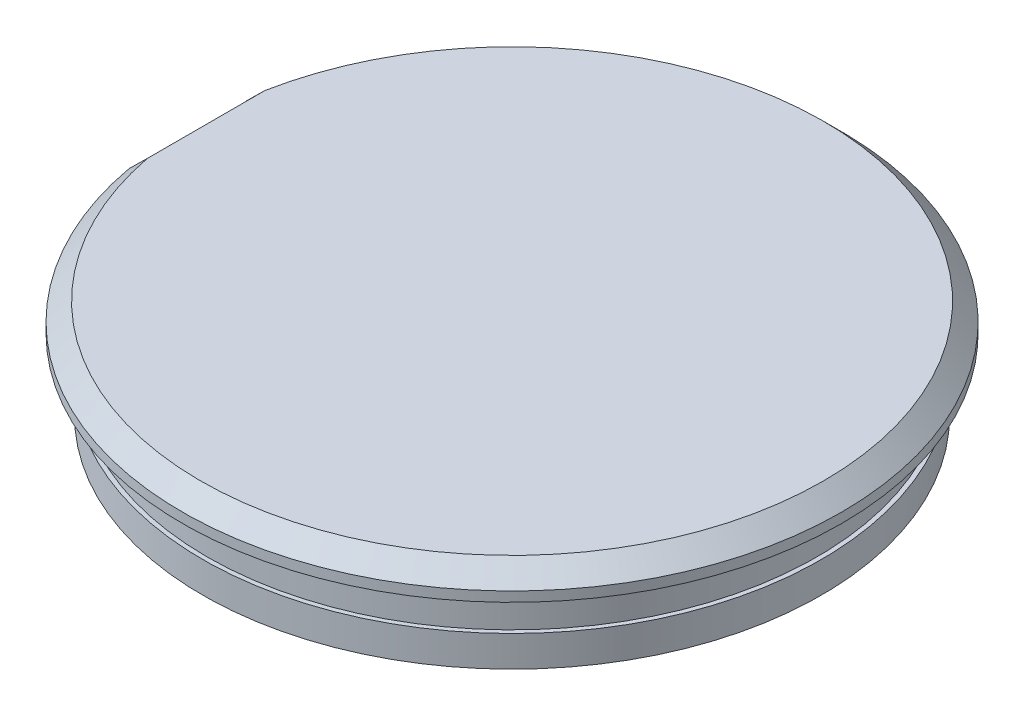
from build123d import *

# Parameters (mm, degrees)
SKETCH3_W          = 1.60489437
SKETCH3_H          = 3.987584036
CUT_EXTRUDE1_DEPTH = 10
SKETCH4_W          = 3.987584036
SKETCH4_H          = 0.501582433
CUT_EXTRUDE2_DEPTH = 1


with BuildPart() as part:
    # Sketch2 → Revolve1 (revolve)
    with BuildSketch(Plane.XY, mode=Mode.PRIVATE) as revolve1_sk:
        Polygon((0, 0.091979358), (10.5, 0.091979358), (10.5, 1.141979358), (10.35, 1.141979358), (10.35, 2.541979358), (11.18595809, 2.541979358), (11.18595809, 2.876435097), (10.573197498, 3.489195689), (0, 3.489195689), align=None)
    revolve(revolve1_sk.sketch.rotate(Axis((0, 0, 0), (0, 1, 0)), 90), axis=Axis((0, 0, 0), (0, 1, 0)))

    # Sketch3 → Cut-Extrude1 (cut)
    with BuildSketch(Plane(origin=(0, 3.489195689, 0), x_dir=(1, 0, 0), z_dir=(0, 1, 0))):
        with Locations((-11.18595809, 0)):
            Rectangle(SKETCH3_W, SKETCH3_H)
    extrude(amount=-CUT_EXTRUDE1_DEPTH, mode=Mode.SUBTRACT)

    # Sketch4 → Cut-Extrude2 (cut)
    with BuildSketch(Plane.ZY.offset(10.383510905)):
        with Locations((0, 2.792770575)):
            Rectangle(SKETCH4_W, SKETCH4_H)
    extrude(amount=-CUT_EXTRUDE2_DEPTH, mode=Mode.SUBTRACT)


solid = part.part
